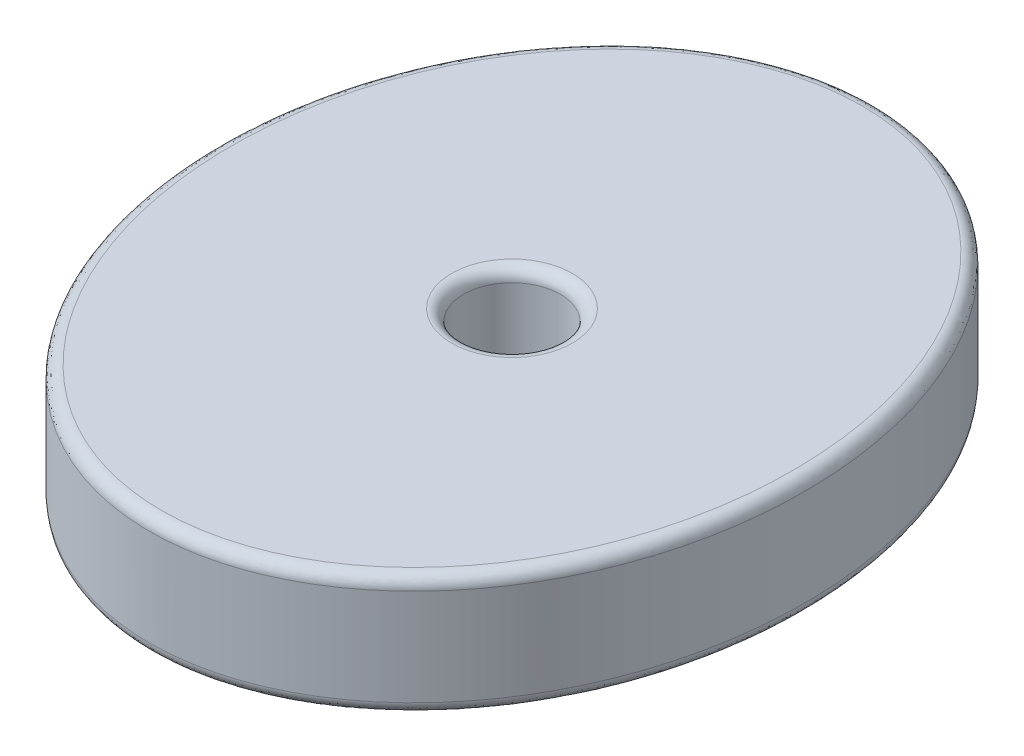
from build123d import *

# Parameters (mm, degrees)
SKETCH2_RX          = 30
SKETCH2_RY          = 24.253479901
SKETCH2_R           = 4
BOSS_EXTRUDE1_DEPTH = 10
FILLET1_R           = 1


with BuildPart() as part:
    # Sketch2 → Boss-Extrude1 (new body)
    with BuildSketch(Plane(origin=(0, 0, 0), x_dir=(1, 0, 0), z_dir=(0, 1, 0))):
        with Locations(Location((0, 0), (0, 0, 90))):
            Ellipse(SKETCH2_RX, SKETCH2_RY)
        with Locations(Location((0, 0, 0), (0, 0, 270))):
            Circle(SKETCH2_R, mode=Mode.SUBTRACT)
    extrude(amount=BOSS_EXTRUDE1_DEPTH)

    # Fillet1
    fillet1_edges = [part.edges().sort_by_distance(p)[0] for p in [
        (0.003262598, 0, 29.999999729),
        (0.003262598, 10, 29.999999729),
        (0, 10, -4),
    ]]
    fillet(fillet1_edges, radius=FILLET1_R)


solid = part.part
